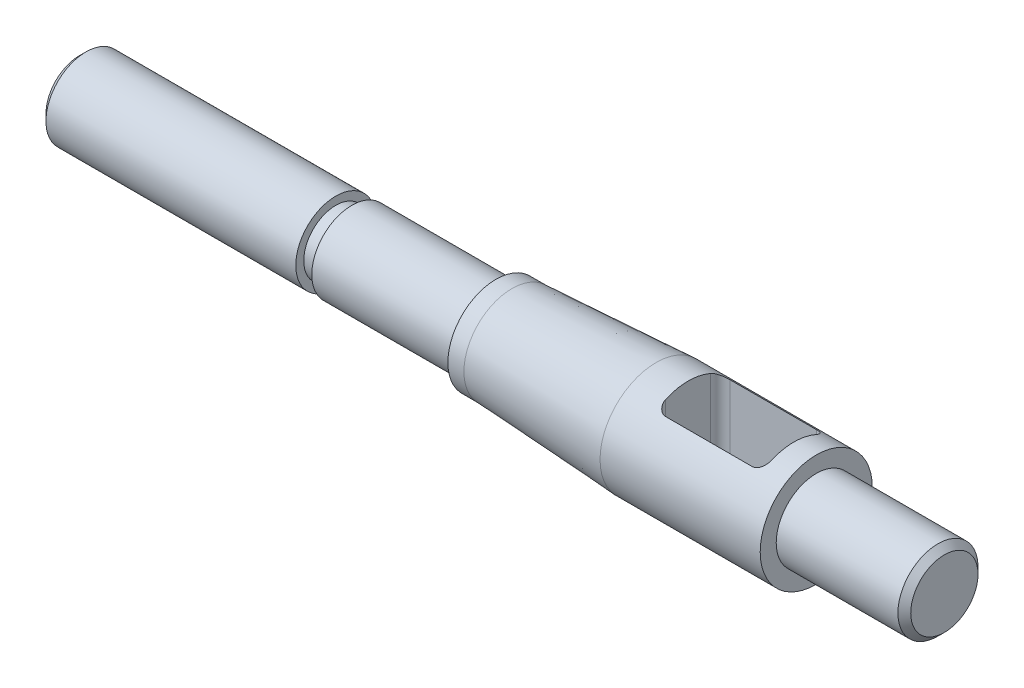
ISO-10303-21;
HEADER;
FILE_DESCRIPTION(('STEP AP214'),'2;1');
FILE_NAME('part.step','',(''),(''),'','','');
FILE_SCHEMA(('AUTOMOTIVE_DESIGN { 1 0 10303 214 1 1 1 1 }'));
ENDSEC;
DATA;
#1=APPLICATION_CONTEXT('core data for automotive mechanical design processes');
#2=APPLICATION_PROTOCOL_DEFINITION('international standard','automotive_design',2000,#1);
#3=PRODUCT_CONTEXT('',#1,'mechanical');
#4=PRODUCT('Part','Part','',(#3));
#5=PRODUCT_RELATED_PRODUCT_CATEGORY('part','',(#4));
#6=PRODUCT_DEFINITION_FORMATION('','',#4);
#7=PRODUCT_DEFINITION_CONTEXT('part definition',#1,'design');
#8=PRODUCT_DEFINITION('design','',#6,#7);
#9=PRODUCT_DEFINITION_SHAPE('','',#8);
#10=(LENGTH_UNIT() NAMED_UNIT(*) SI_UNIT(.MILLI.,.METRE.));
#11=(NAMED_UNIT(*) PLANE_ANGLE_UNIT() SI_UNIT($,.RADIAN.));
#12=(NAMED_UNIT(*) SI_UNIT($,.STERADIAN.) SOLID_ANGLE_UNIT());
#13=UNCERTAINTY_MEASURE_WITH_UNIT(LENGTH_MEASURE(1.E-05),#10,'distance_accuracy_value','');
#14=(GEOMETRIC_REPRESENTATION_CONTEXT(3) GLOBAL_UNCERTAINTY_ASSIGNED_CONTEXT((#13)) GLOBAL_UNIT_ASSIGNED_CONTEXT((#10,
#11,#12)) REPRESENTATION_CONTEXT('',''));
#15=CARTESIAN_POINT('',(0.,0.,0.));
#16=DIRECTION('',(0.,0.,1.));
#17=DIRECTION('',(1.,0.,0.));
#18=AXIS2_PLACEMENT_3D('',#15,#16,#17);
#19=CARTESIAN_POINT('',(130.,0.,0.));
#20=DIRECTION('',(-1.,0.,0.));
#21=DIRECTION('',(0.,0.,1.));
#22=AXIS2_PLACEMENT_3D('',#19,#20,#21);
#23=CYLINDRICAL_SURFACE('',#22,12.5);
#24=CARTESIAN_POINT('',(130.,0.,0.));
#25=DIRECTION('',(1.,0.,0.));
#26=DIRECTION('',(0.,0.,-1.));
#27=AXIS2_PLACEMENT_3D('',#24,#25,#26);
#28=CIRCLE('',#27,12.5);
#29=CARTESIAN_POINT('',(130.,0.,-12.5));
#30=VERTEX_POINT('',#29);
#31=EDGE_CURVE('E348',#30,#30,#28,.T.);
#32=ORIENTED_EDGE('',*,*,#31,.F.);
#33=EDGE_LOOP('',(#32));
#34=FACE_BOUND('',#33,.T.);
#35=CARTESIAN_POINT('',(85.,0.,0.));
#36=DIRECTION('',(-1.,0.,0.));
#37=DIRECTION('',(0.,0.,1.));
#38=AXIS2_PLACEMENT_3D('',#35,#36,#37);
#39=CIRCLE('',#38,12.5);
#40=CARTESIAN_POINT('',(85.,0.,12.5));
#41=VERTEX_POINT('',#40);
#42=EDGE_CURVE('E288',#41,#41,#39,.T.);
#43=ORIENTED_EDGE('',*,*,#42,.F.);
#44=EDGE_LOOP('',(#43));
#45=FACE_BOUND('',#44,.T.);
#46=ADVANCED_FACE('F32',(#34,#45),#23,.T.);
#47=CARTESIAN_POINT('',(230.,0.,0.));
#48=DIRECTION('',(-1.,0.,0.));
#49=DIRECTION('',(0.,0.,1.));
#50=AXIS2_PLACEMENT_3D('',#47,#48,#49);
#51=CYLINDRICAL_SURFACE('',#50,17.5);
#52=CARTESIAN_POINT('',(180.,0.,0.));
#53=DIRECTION('',(-1.,0.,0.));
#54=DIRECTION('',(0.,0.,1.));
#55=AXIS2_PLACEMENT_3D('',#52,#53,#54);
#56=CIRCLE('',#55,17.5);
#57=CARTESIAN_POINT('',(180.,0.,17.5));
#58=VERTEX_POINT('',#57);
#59=EDGE_CURVE('E287',#58,#58,#56,.T.);
#60=ORIENTED_EDGE('',*,*,#59,.F.);
#61=EDGE_LOOP('',(#60));
#62=FACE_BOUND('',#61,.T.);
#63=CARTESIAN_POINT('',(230.,0.,0.));
#64=DIRECTION('',(1.,0.,0.));
#65=DIRECTION('',(0.,0.,-1.));
#66=AXIS2_PLACEMENT_3D('',#63,#64,#65);
#67=CIRCLE('',#66,17.5);
#68=CARTESIAN_POINT('',(230.,0.,-17.5));
#69=VERTEX_POINT('',#68);
#70=EDGE_CURVE('E346',#69,#69,#67,.T.);
#71=ORIENTED_EDGE('',*,*,#70,.F.);
#72=EDGE_LOOP('',(#71));
#73=FACE_BOUND('',#72,.T.);
#74=DIRECTION('',(-1.,0.,0.));
#75=VECTOR('',#74,1.);
#76=CARTESIAN_POINT('',(230.,14.3614066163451,-10.));
#77=LINE('',#76,#75);
#78=CARTESIAN_POINT('',(220.,14.3614066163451,-10.));
#79=VERTEX_POINT('',#78);
#80=CARTESIAN_POINT('',(193.,14.3614066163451,-10.));
#81=VERTEX_POINT('',#80);
#82=EDGE_CURVE('E362',#79,#81,#77,.T.);
#83=ORIENTED_EDGE('',*,*,#82,.F.);
#84=CARTESIAN_POINT('',(220.,14.3614066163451,-10.));
#85=CARTESIAN_POINT('',(220.074647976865,14.3613913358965,-10.0000148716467));
#86=CARTESIAN_POINT('',(220.14928495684,14.363346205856,-9.9972143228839));
#87=CARTESIAN_POINT('',(220.297906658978,14.3710800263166,-9.98609744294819));
#88=CARTESIAN_POINT('',(220.371891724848,14.376856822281,-9.97778421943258));
#89=CARTESIAN_POINT('',(220.518218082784,14.3920720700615,-9.95582384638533));
#90=CARTESIAN_POINT('',(220.590566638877,14.4014880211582,-9.94220946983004));
#91=CARTESIAN_POINT('',(220.733552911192,14.4237677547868,-9.90985917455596));
#92=CARTESIAN_POINT('',(220.804190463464,14.4366318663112,-9.89112276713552));
#93=CARTESIAN_POINT('',(221.012551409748,14.4799675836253,-9.82767399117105));
#94=CARTESIAN_POINT('',(221.147144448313,14.5152285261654,-9.77565702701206));
#95=CARTESIAN_POINT('',(221.405051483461,14.5961112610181,-9.65447152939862));
#96=CARTESIAN_POINT('',(221.528348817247,14.6417480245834,-9.58527819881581));
#97=CARTESIAN_POINT('',(221.771363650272,14.7448936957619,-9.42591164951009));
#98=CARTESIAN_POINT('',(221.889979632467,14.8030653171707,-9.3344919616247));
#99=CARTESIAN_POINT('',(222.110622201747,14.9257100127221,-9.13710562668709));
#100=CARTESIAN_POINT('',(222.212642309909,14.9901855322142,-9.03113332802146));
#101=CARTESIAN_POINT('',(222.414888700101,15.134146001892,-8.78810094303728));
#102=CARTESIAN_POINT('',(222.511941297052,15.2143340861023,-8.6488081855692));
#103=CARTESIAN_POINT('',(222.680960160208,15.3766573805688,-8.35681562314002));
#104=CARTESIAN_POINT('',(222.752917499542,15.4587932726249,-8.20411107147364));
#105=CARTESIAN_POINT('',(222.873310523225,15.6263351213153,-7.88050452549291));
#106=CARTESIAN_POINT('',(222.920408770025,15.711702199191,-7.7090762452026));
#107=CARTESIAN_POINT('',(222.967916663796,15.8369301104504,-7.44655114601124));
#108=CARTESIAN_POINT('',(222.979896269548,15.8782252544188,-7.3580931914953));
#109=CARTESIAN_POINT('',(222.995936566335,15.9596005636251,-7.17988628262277));
#110=CARTESIAN_POINT('',(222.999995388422,15.9996804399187,-7.09013702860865));
#111=CARTESIAN_POINT('',(223.,16.0390149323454,-7.));
#112=B_SPLINE_CURVE_WITH_KNOTS('',3,(#84,#85,#86,#87,#88,#89,#90,#91,#92,#93,#94,#95,#96,#97,
#98,#99,#100,#101,#102,#103,#104,#105,#106,#107,#108,#109,#110,#111),.UNSPECIFIED.,.F.,.F.,(4,2,
2,2,2,2,2,2,2,2,2,2,2,4),(0.,0.223847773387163,0.447569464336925,0.669929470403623,
0.892310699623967,1.33580324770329,1.77993981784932,2.2601003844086,2.74044795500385,
3.3013994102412,3.86255020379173,4.45141939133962,4.74619356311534,5.04103727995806),.UNSPECIFIED.);
#113=CARTESIAN_POINT('',(223.,16.0390149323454,-7.));
#114=VERTEX_POINT('',#113);
#115=EDGE_CURVE('E179',#79,#114,#112,.T.);
#116=ORIENTED_EDGE('',*,*,#115,.T.);
#117=CARTESIAN_POINT('',(223.,0.,0.));
#118=DIRECTION('',(1.,0.,0.));
#119=DIRECTION('',(0.,0.,-1.));
#120=AXIS2_PLACEMENT_3D('',#117,#118,#119);
#121=CIRCLE('',#120,17.5);
#122=CARTESIAN_POINT('',(223.,16.0390149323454,7.));
#123=VERTEX_POINT('',#122);
#124=EDGE_CURVE('E356',#114,#123,#121,.T.);
#125=ORIENTED_EDGE('',*,*,#124,.T.);
#126=CARTESIAN_POINT('',(223.,16.0390149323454,7.));
#127=CARTESIAN_POINT('',(223.000002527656,15.9980461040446,7.09389265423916));
#128=CARTESIAN_POINT('',(222.995592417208,15.9562456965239,7.18739984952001));
#129=CARTESIAN_POINT('',(222.978181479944,15.8713420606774,7.37297987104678));
#130=CARTESIAN_POINT('',(222.965183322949,15.8282392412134,7.46505313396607));
#131=CARTESIAN_POINT('',(222.93084392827,15.7410991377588,7.64709013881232));
#132=CARTESIAN_POINT('',(222.909509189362,15.6970626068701,7.73705546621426));
#133=CARTESIAN_POINT('',(222.858750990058,15.6084190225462,7.91436044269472));
#134=CARTESIAN_POINT('',(222.829326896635,15.5638119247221,8.00169988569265));
#135=CARTESIAN_POINT('',(222.729311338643,15.4298134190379,8.25881438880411));
#136=CARTESIAN_POINT('',(222.646914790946,15.3400891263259,8.42400888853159));
#137=CARTESIAN_POINT('',(222.452423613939,15.1635807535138,8.73775454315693));
#138=CARTESIAN_POINT('',(222.340302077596,15.0767994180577,8.8862904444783));
#139=CARTESIAN_POINT('',(222.086849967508,14.9099842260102,9.16344105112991));
#140=CARTESIAN_POINT('',(221.945311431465,14.8300044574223,9.2919018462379));
#141=CARTESIAN_POINT('',(221.713584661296,14.7200950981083,9.46432782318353));
#142=CARTESIAN_POINT('',(221.633126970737,14.6851423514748,9.51841534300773));
#143=CARTESIAN_POINT('',(221.466126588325,14.6193523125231,9.61915483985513));
#144=CARTESIAN_POINT('',(221.379586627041,14.5885131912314,9.6658101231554));
#145=CARTESIAN_POINT('',(221.161522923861,14.5192499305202,9.76968953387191));
#146=CARTESIAN_POINT('',(221.026993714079,14.4834796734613,9.82249900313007));
#147=CARTESIAN_POINT('',(220.749348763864,14.4247681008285,9.90852252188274));
#148=CARTESIAN_POINT('',(220.606252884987,14.4017982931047,9.94178010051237));
#149=CARTESIAN_POINT('',(220.384909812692,14.3779555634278,9.97620093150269));
#150=CARTESIAN_POINT('',(220.308351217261,14.3717685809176,9.98510640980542));
#151=CARTESIAN_POINT('',(220.154542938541,14.3634882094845,9.99701102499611));
#152=CARTESIAN_POINT('',(220.077293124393,14.3613956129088,10.0000090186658));
#153=CARTESIAN_POINT('',(220.,14.3614066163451,10.));
#154=B_SPLINE_CURVE_WITH_KNOTS('',3,(#126,#127,#128,#129,#130,#131,#132,#133,#134,#135,#136,
#137,#138,#139,#140,#141,#142,#143,#144,#145,#146,#147,#148,#149,#150,#151,#152,#153),
.UNSPECIFIED.,.F.,.F.,(4,2,2,2,2,2,2,2,2,2,2,2,2,4),(0.,0.307194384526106,0.614293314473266,
0.921153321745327,1.22803734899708,1.84072633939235,2.45397184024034,3.07170985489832,
3.38043466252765,3.68902174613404,4.13371543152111,4.57741529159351,4.80908120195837,
5.04079193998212),.UNSPECIFIED.);
#155=CARTESIAN_POINT('',(220.,14.3614066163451,10.));
#156=VERTEX_POINT('',#155);
#157=EDGE_CURVE('E173',#123,#156,#154,.T.);
#158=ORIENTED_EDGE('',*,*,#157,.T.);
#159=DIRECTION('',(-1.,0.,0.));
#160=VECTOR('',#159,1.);
#161=CARTESIAN_POINT('',(230.,14.3614066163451,10.));
#162=LINE('',#161,#160);
#163=CARTESIAN_POINT('',(193.,14.3614066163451,10.));
#164=VERTEX_POINT('',#163);
#165=EDGE_CURVE('E351',#156,#164,#162,.T.);
#166=ORIENTED_EDGE('',*,*,#165,.T.);
#167=CARTESIAN_POINT('',(193.,14.3614066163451,10.));
#168=CARTESIAN_POINT('',(192.925352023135,14.3613913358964,10.0000148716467));
#169=CARTESIAN_POINT('',(192.85071504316,14.363346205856,9.99721432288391));
#170=CARTESIAN_POINT('',(192.702093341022,14.3710800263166,9.98609744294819));
#171=CARTESIAN_POINT('',(192.628108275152,14.376856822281,9.97778421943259));
#172=CARTESIAN_POINT('',(192.481781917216,14.3920720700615,9.95582384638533));
#173=CARTESIAN_POINT('',(192.409433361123,14.4014880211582,9.94220946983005));
#174=CARTESIAN_POINT('',(192.266447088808,14.4237677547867,9.90985917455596));
#175=CARTESIAN_POINT('',(192.195809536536,14.4366318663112,9.89112276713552));
#176=CARTESIAN_POINT('',(191.987448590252,14.4799675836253,9.82767399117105));
#177=CARTESIAN_POINT('',(191.852855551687,14.5152285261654,9.77565702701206));
#178=CARTESIAN_POINT('',(191.594948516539,14.5961112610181,9.65447152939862));
#179=CARTESIAN_POINT('',(191.471651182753,14.6417480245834,9.58527819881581));
#180=CARTESIAN_POINT('',(191.228636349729,14.7448936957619,9.42591164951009));
#181=CARTESIAN_POINT('',(191.110020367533,14.8030653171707,9.3344919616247));
#182=CARTESIAN_POINT('',(190.889377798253,14.9257100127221,9.13710562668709));
#183=CARTESIAN_POINT('',(190.787357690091,14.9901855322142,9.03113332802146));
#184=CARTESIAN_POINT('',(190.585111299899,15.134146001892,8.78810094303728));
#185=CARTESIAN_POINT('',(190.488058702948,15.2143340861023,8.6488081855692));
#186=CARTESIAN_POINT('',(190.319039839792,15.3766573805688,8.35681562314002));
#187=CARTESIAN_POINT('',(190.247082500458,15.4587932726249,8.20411107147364));
#188=CARTESIAN_POINT('',(190.126689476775,15.6263351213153,7.88050452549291));
#189=CARTESIAN_POINT('',(190.079591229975,15.711702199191,7.7090762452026));
#190=CARTESIAN_POINT('',(190.032083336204,15.8369301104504,7.44655114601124));
#191=CARTESIAN_POINT('',(190.020103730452,15.8782252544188,7.3580931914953));
#192=CARTESIAN_POINT('',(190.004063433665,15.9596005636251,7.17988628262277));
#193=CARTESIAN_POINT('',(190.000004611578,15.9996804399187,7.09013702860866));
#194=CARTESIAN_POINT('',(190.,16.0390149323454,7.));
#195=B_SPLINE_CURVE_WITH_KNOTS('',3,(#167,#168,#169,#170,#171,#172,#173,#174,#175,#176,#177,
#178,#179,#180,#181,#182,#183,#184,#185,#186,#187,#188,#189,#190,#191,#192,#193,#194),
.UNSPECIFIED.,.F.,.F.,(4,2,2,2,2,2,2,2,2,2,2,2,2,4),(0.,0.223847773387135,0.447569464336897,
0.669929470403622,0.892310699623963,1.33580324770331,1.77993981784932,2.26010038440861,
2.74044795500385,3.3013994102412,3.86255020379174,4.45141939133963,4.74619356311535,
5.04103727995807),.UNSPECIFIED.);
#196=CARTESIAN_POINT('',(190.,16.0390149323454,7.));
#197=VERTEX_POINT('',#196);
#198=EDGE_CURVE('E45',#164,#197,#195,.T.);
#199=ORIENTED_EDGE('',*,*,#198,.T.);
#200=CARTESIAN_POINT('',(190.,0.,0.));
#201=DIRECTION('',(-1.,0.,0.));
#202=DIRECTION('',(0.,0.,1.));
#203=AXIS2_PLACEMENT_3D('',#200,#201,#202);
#204=CIRCLE('',#203,17.5);
#205=CARTESIAN_POINT('',(190.,16.0390149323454,-7.));
#206=VERTEX_POINT('',#205);
#207=EDGE_CURVE('E359',#197,#206,#204,.T.);
#208=ORIENTED_EDGE('',*,*,#207,.T.);
#209=CARTESIAN_POINT('',(190.,16.0390149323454,-7.));
#210=CARTESIAN_POINT('',(189.999997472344,15.9980461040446,-7.09389265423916));
#211=CARTESIAN_POINT('',(190.004407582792,15.9562456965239,-7.18739984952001));
#212=CARTESIAN_POINT('',(190.021818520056,15.8713420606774,-7.37297987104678));
#213=CARTESIAN_POINT('',(190.034816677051,15.8282392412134,-7.46505313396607));
#214=CARTESIAN_POINT('',(190.06915607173,15.7410991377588,-7.64709013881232));
#215=CARTESIAN_POINT('',(190.090490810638,15.6970626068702,-7.73705546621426));
#216=CARTESIAN_POINT('',(190.141249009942,15.6084190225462,-7.91436044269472));
#217=CARTESIAN_POINT('',(190.170673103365,15.5638119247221,-8.00169988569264));
#218=CARTESIAN_POINT('',(190.270688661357,15.4298134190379,-8.2588143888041));
#219=CARTESIAN_POINT('',(190.353085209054,15.3400891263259,-8.42400888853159));
#220=CARTESIAN_POINT('',(190.547576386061,15.1635807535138,-8.73775454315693));
#221=CARTESIAN_POINT('',(190.659697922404,15.0767994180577,-8.8862904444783));
#222=CARTESIAN_POINT('',(190.913150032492,14.9099842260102,-9.1634410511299));
#223=CARTESIAN_POINT('',(191.054688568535,14.8300044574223,-9.29190184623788));
#224=CARTESIAN_POINT('',(191.286415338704,14.7200950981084,-9.46432782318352));
#225=CARTESIAN_POINT('',(191.366873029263,14.6851423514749,-9.51841534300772));
#226=CARTESIAN_POINT('',(191.533873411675,14.6193523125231,-9.61915483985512));
#227=CARTESIAN_POINT('',(191.620413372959,14.5885131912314,-9.66581012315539));
#228=CARTESIAN_POINT('',(191.838477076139,14.5192499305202,-9.76968953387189));
#229=CARTESIAN_POINT('',(191.973006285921,14.4834796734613,-9.82249900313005));
#230=CARTESIAN_POINT('',(192.250651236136,14.4247681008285,-9.90852252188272));
#231=CARTESIAN_POINT('',(192.393747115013,14.4017982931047,-9.94178010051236));
#232=CARTESIAN_POINT('',(192.615090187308,14.3779555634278,-9.9762009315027));
#233=CARTESIAN_POINT('',(192.691648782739,14.3717685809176,-9.98510640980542));
#234=CARTESIAN_POINT('',(192.845457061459,14.3634882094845,-9.99701102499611));
#235=CARTESIAN_POINT('',(192.922706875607,14.3613956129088,-10.0000090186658));
#236=CARTESIAN_POINT('',(193.,14.3614066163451,-10.));
#237=B_SPLINE_CURVE_WITH_KNOTS('',3,(#209,#210,#211,#212,#213,#214,#215,#216,#217,#218,#219,
#220,#221,#222,#223,#224,#225,#226,#227,#228,#229,#230,#231,#232,#233,#234,#235,#236),
.UNSPECIFIED.,.F.,.F.,(4,2,2,2,2,2,2,2,2,2,2,2,2,4),(0.,0.307194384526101,0.614293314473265,
0.92115332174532,1.22803734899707,1.84072633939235,2.45397184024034,3.07170985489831,
3.38043466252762,3.68902174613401,4.13371543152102,4.57741529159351,4.80908120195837,
5.04079193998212),.UNSPECIFIED.);
#238=EDGE_CURVE('E12',#206,#81,#237,.T.);
#239=ORIENTED_EDGE('',*,*,#238,.T.);
#240=EDGE_LOOP('',(#83,#116,#125,#158,#166,#199,#208,#239));
#241=FACE_BOUND('',#240,.T.);
#242=ADVANCED_FACE('F184',(#62,#73,#241),#51,.T.);
#243=CARTESIAN_POINT('',(230.,0.,0.));
#244=DIRECTION('',(1.,0.,0.));
#245=DIRECTION('',(0.,0.,-1.));
#246=AXIS2_PLACEMENT_3D('',#243,#244,#245);
#247=PLANE('',#246);
#248=ORIENTED_EDGE('',*,*,#70,.T.);
#249=EDGE_LOOP('',(#248));
#250=FACE_BOUND('',#249,.T.);
#251=CARTESIAN_POINT('',(230.,0.,0.));
#252=DIRECTION('',(1.,0.,0.));
#253=DIRECTION('',(0.,0.,-1.));
#254=AXIS2_PLACEMENT_3D('',#251,#252,#253);
#255=CIRCLE('',#254,12.5);
#256=CARTESIAN_POINT('',(230.,0.,12.5));
#257=VERTEX_POINT('',#256);
#258=EDGE_CURVE('E343',#257,#257,#255,.T.);
#259=ORIENTED_EDGE('',*,*,#258,.F.);
#260=EDGE_LOOP('',(#259));
#261=FACE_BOUND('',#260,.T.);
#262=ADVANCED_FACE('F257',(#250,#261),#247,.T.);
#263=CARTESIAN_POINT('',(270.,0.,0.));
#264=DIRECTION('',(-1.,0.,0.));
#265=DIRECTION('',(0.,0.,1.));
#266=AXIS2_PLACEMENT_3D('',#263,#264,#265);
#267=CYLINDRICAL_SURFACE('',#266,12.5);
#268=CARTESIAN_POINT('',(268.,0.,0.));
#269=DIRECTION('',(1.,0.,0.));
#270=DIRECTION('',(0.,0.,-1.));
#271=AXIS2_PLACEMENT_3D('',#268,#269,#270);
#272=CIRCLE('',#271,12.5);
#273=CARTESIAN_POINT('',(268.,0.,12.5));
#274=VERTEX_POINT('',#273);
#275=EDGE_CURVE('E368',#274,#274,#272,.F.);
#276=CARTESIAN_POINT('',(268.,0.,12.5));
#277=CARTESIAN_POINT('',(267.604166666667,0.,12.5));
#278=CARTESIAN_POINT('',(267.208333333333,0.,12.5));
#279=CARTESIAN_POINT('',(266.416666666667,0.,12.5));
#280=CARTESIAN_POINT('',(266.020833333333,0.,12.5));
#281=CARTESIAN_POINT('',(265.229166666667,0.,12.5));
#282=CARTESIAN_POINT('',(264.833333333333,0.,12.5));
#283=CARTESIAN_POINT('',(264.041666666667,0.,12.5));
#284=CARTESIAN_POINT('',(263.645833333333,0.,12.5));
#285=CARTESIAN_POINT('',(262.854166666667,0.,12.5));
#286=CARTESIAN_POINT('',(262.458333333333,0.,12.5));
#287=CARTESIAN_POINT('',(261.666666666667,0.,12.5));
#288=CARTESIAN_POINT('',(261.270833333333,0.,12.5));
#289=CARTESIAN_POINT('',(260.479166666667,0.,12.5));
#290=CARTESIAN_POINT('',(260.083333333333,0.,12.5));
#291=CARTESIAN_POINT('',(259.291666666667,0.,12.5));
#292=CARTESIAN_POINT('',(258.895833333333,0.,12.5));
#293=CARTESIAN_POINT('',(258.104166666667,0.,12.5));
#294=CARTESIAN_POINT('',(257.708333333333,0.,12.5));
#295=CARTESIAN_POINT('',(256.916666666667,0.,12.5));
#296=CARTESIAN_POINT('',(256.520833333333,0.,12.5));
#297=CARTESIAN_POINT('',(255.729166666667,0.,12.5));
#298=CARTESIAN_POINT('',(255.333333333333,0.,12.5));
#299=CARTESIAN_POINT('',(254.541666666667,0.,12.5));
#300=CARTESIAN_POINT('',(254.145833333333,0.,12.5));
#301=CARTESIAN_POINT('',(253.354166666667,0.,12.5));
#302=CARTESIAN_POINT('',(252.958333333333,0.,12.5));
#303=CARTESIAN_POINT('',(252.166666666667,0.,12.5));
#304=CARTESIAN_POINT('',(251.770833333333,0.,12.5));
#305=CARTESIAN_POINT('',(250.979166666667,0.,12.5));
#306=CARTESIAN_POINT('',(250.583333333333,0.,12.5));
#307=CARTESIAN_POINT('',(249.791666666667,0.,12.5));
#308=CARTESIAN_POINT('',(249.395833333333,0.,12.5));
#309=CARTESIAN_POINT('',(248.604166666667,0.,12.5));
#310=CARTESIAN_POINT('',(248.208333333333,0.,12.5));
#311=CARTESIAN_POINT('',(247.416666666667,0.,12.5));
#312=CARTESIAN_POINT('',(247.020833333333,0.,12.5));
#313=CARTESIAN_POINT('',(246.229166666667,0.,12.5));
#314=CARTESIAN_POINT('',(245.833333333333,0.,12.5));
#315=CARTESIAN_POINT('',(245.041666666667,0.,12.5));
#316=CARTESIAN_POINT('',(244.645833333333,0.,12.5));
#317=CARTESIAN_POINT('',(243.854166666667,0.,12.5));
#318=CARTESIAN_POINT('',(243.458333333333,0.,12.5));
#319=CARTESIAN_POINT('',(242.666666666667,0.,12.5));
#320=CARTESIAN_POINT('',(242.270833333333,0.,12.5));
#321=CARTESIAN_POINT('',(241.479166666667,0.,12.5));
#322=CARTESIAN_POINT('',(241.083333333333,0.,12.5));
#323=CARTESIAN_POINT('',(240.291666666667,0.,12.5));
#324=CARTESIAN_POINT('',(239.895833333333,0.,12.5));
#325=CARTESIAN_POINT('',(239.104166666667,0.,12.5));
#326=CARTESIAN_POINT('',(238.708333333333,0.,12.5));
#327=CARTESIAN_POINT('',(237.916666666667,0.,12.5));
#328=CARTESIAN_POINT('',(237.520833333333,0.,12.5));
#329=CARTESIAN_POINT('',(236.729166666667,0.,12.5));
#330=CARTESIAN_POINT('',(236.333333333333,0.,12.5));
#331=CARTESIAN_POINT('',(235.541666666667,0.,12.5));
#332=CARTESIAN_POINT('',(235.145833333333,0.,12.5));
#333=CARTESIAN_POINT('',(234.354166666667,0.,12.5));
#334=CARTESIAN_POINT('',(233.958333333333,0.,12.5));
#335=CARTESIAN_POINT('',(233.166666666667,0.,12.5));
#336=CARTESIAN_POINT('',(232.770833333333,0.,12.5));
#337=CARTESIAN_POINT('',(231.979166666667,0.,12.5));
#338=CARTESIAN_POINT('',(231.583333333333,0.,12.5));
#339=CARTESIAN_POINT('',(230.791666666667,0.,12.5));
#340=CARTESIAN_POINT('',(230.395833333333,0.,12.5));
#341=CARTESIAN_POINT('',(230.,0.,12.5));
#342=B_SPLINE_CURVE_WITH_KNOTS('',3,(#276,#277,#278,#279,#280,#281,#282,#283,#284,#285,#286,
#287,#288,#289,#290,#291,#292,#293,#294,#295,#296,#297,#298,#299,#300,#301,#302,#303,#304,#305,
#306,#307,#308,#309,#310,#311,#312,#313,#314,#315,#316,#317,#318,#319,#320,#321,#322,#323,#324,
#325,#326,#327,#328,#329,#330,#331,#332,#333,#334,#335,#336,#337,#338,#339,#340,#341),
.UNSPECIFIED.,.F.,.F.,(4,2,2,2,2,2,2,2,2,2,2,2,2,2,2,2,2,2,2,2,2,2,2,2,2,2,2,2,2,2,2,2,4),(0.,
1.18749999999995,2.37499999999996,3.56249999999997,4.74999999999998,5.93749999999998,
7.12499999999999,8.31249999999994,9.49999999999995,10.6875,11.875,13.0625,14.25,
15.4374999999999,16.6249999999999,17.8125,19.,20.1875,21.375,22.5625,23.75,24.9374999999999,
26.125,27.3125,28.4999999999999,29.6875,30.875,32.0624999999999,33.2499999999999,34.4375,
35.6249999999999,36.8124999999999,38.),.UNSPECIFIED.);
#343=EDGE_CURVE('BSEAM253',#274,#257,#342,.T.);
#344=ORIENTED_EDGE('',*,*,#275,.T.);
#345=ORIENTED_EDGE('',*,*,#258,.T.);
#346=ORIENTED_EDGE('',*,*,#343,.T.);
#347=ORIENTED_EDGE('',*,*,#343,.F.);
#348=EDGE_LOOP('',(#344,#346,#345,#347));
#349=FACE_BOUND('',#348,.T.);
#350=ADVANCED_FACE('F253',(#349),#267,.T.);
#351=CARTESIAN_POINT('',(270.,0.,0.));
#352=DIRECTION('',(1.,0.,0.));
#353=DIRECTION('',(0.,0.,-1.));
#354=AXIS2_PLACEMENT_3D('',#351,#352,#353);
#355=PLANE('',#354);
#356=CARTESIAN_POINT('',(270.,0.,0.));
#357=DIRECTION('',(1.,0.,0.));
#358=DIRECTION('',(0.,0.,-1.));
#359=AXIS2_PLACEMENT_3D('',#356,#357,#358);
#360=CIRCLE('',#359,10.5);
#361=CARTESIAN_POINT('',(270.,0.,-10.5));
#362=VERTEX_POINT('',#361);
#363=EDGE_CURVE('E365',#362,#362,#360,.T.);
#364=ORIENTED_EDGE('',*,*,#363,.T.);
#365=EDGE_LOOP('',(#364));
#366=FACE_BOUND('',#365,.T.);
#367=ADVANCED_FACE('F249',(#366),#355,.T.);
#368=CARTESIAN_POINT('',(0.,0.,0.));
#369=DIRECTION('',(-1.,0.,0.));
#370=DIRECTION('',(0.,0.,1.));
#371=AXIS2_PLACEMENT_3D('',#368,#369,#370);
#372=CYLINDRICAL_SURFACE('',#371,15.);
#373=CARTESIAN_POINT('',(135.,0.,0.));
#374=DIRECTION('',(-1.,0.,0.));
#375=DIRECTION('',(0.,0.,1.));
#376=AXIS2_PLACEMENT_3D('',#373,#374,#375);
#377=CIRCLE('',#376,15.);
#378=CARTESIAN_POINT('',(135.,0.,15.));
#379=VERTEX_POINT('',#378);
#380=EDGE_CURVE('E291',#379,#379,#377,.T.);
#381=ORIENTED_EDGE('',*,*,#380,.T.);
#382=EDGE_LOOP('',(#381));
#383=FACE_BOUND('',#382,.T.);
#384=CARTESIAN_POINT('',(130.,0.,0.));
#385=DIRECTION('',(1.,0.,0.));
#386=DIRECTION('',(0.,0.,-1.));
#387=AXIS2_PLACEMENT_3D('',#384,#385,#386);
#388=CIRCLE('',#387,15.);
#389=CARTESIAN_POINT('',(130.,0.,-15.));
#390=VERTEX_POINT('',#389);
#391=EDGE_CURVE('E342',#390,#390,#388,.T.);
#392=ORIENTED_EDGE('',*,*,#391,.T.);
#393=EDGE_LOOP('',(#392));
#394=FACE_BOUND('',#393,.T.);
#395=ADVANCED_FACE('F245',(#383,#394),#372,.T.);
#396=CARTESIAN_POINT('',(135.,0.,0.));
#397=DIRECTION('',(1.,0.,0.));
#398=DIRECTION('',(0.,0.,-1.));
#399=AXIS2_PLACEMENT_3D('',#396,#397,#398);
#400=CONICAL_SURFACE('',#399,15.,0.055498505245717);
#401=ORIENTED_EDGE('',*,*,#59,.T.);
#402=EDGE_LOOP('',(#401));
#403=FACE_BOUND('',#402,.T.);
#404=ORIENTED_EDGE('',*,*,#380,.F.);
#405=EDGE_LOOP('',(#404));
#406=FACE_BOUND('',#405,.T.);
#407=ADVANCED_FACE('F242',(#403,#406),#400,.T.);
#408=CARTESIAN_POINT('',(130.,0.,0.));
#409=DIRECTION('',(1.,0.,0.));
#410=DIRECTION('',(0.,0.,-1.));
#411=AXIS2_PLACEMENT_3D('',#408,#409,#410);
#412=PLANE('',#411);
#413=ORIENTED_EDGE('',*,*,#31,.T.);
#414=EDGE_LOOP('',(#413));
#415=FACE_BOUND('',#414,.T.);
#416=ORIENTED_EDGE('',*,*,#391,.F.);
#417=EDGE_LOOP('',(#416));
#418=FACE_BOUND('',#417,.T.);
#419=ADVANCED_FACE('F240',(#415,#418),#412,.F.);
#420=CARTESIAN_POINT('',(190.,23.0555555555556,-10.));
#421=DIRECTION('',(-1.,0.,0.));
#422=DIRECTION('',(0.,0.,1.));
#423=AXIS2_PLACEMENT_3D('',#420,#421,#422);
#424=PLANE('',#423);
#425=ORIENTED_EDGE('',*,*,#207,.F.);
#426=DIRECTION('',(0.,-1.,0.));
#427=VECTOR('',#426,1.);
#428=CARTESIAN_POINT('',(190.,-12.,7.));
#429=LINE('',#428,#427);
#430=CARTESIAN_POINT('',(190.,-9.00000000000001,7.));
#431=VERTEX_POINT('',#430);
#432=EDGE_CURVE('E155',#197,#431,#429,.T.);
#433=ORIENTED_EDGE('',*,*,#432,.T.);
#434=DIRECTION('',(0.,0.,1.));
#435=VECTOR('',#434,1.);
#436=CARTESIAN_POINT('',(190.,-9.00000000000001,-10.));
#437=LINE('',#436,#435);
#438=CARTESIAN_POINT('',(190.,-9.00000000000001,-7.));
#439=VERTEX_POINT('',#438);
#440=EDGE_CURVE('E120',#431,#439,#437,.F.);
#441=ORIENTED_EDGE('',*,*,#440,.T.);
#442=DIRECTION('',(0.,-1.,0.));
#443=VECTOR('',#442,1.);
#444=CARTESIAN_POINT('',(190.,23.0555555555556,-7.));
#445=LINE('',#444,#443);
#446=EDGE_CURVE('E148',#439,#206,#445,.F.);
#447=ORIENTED_EDGE('',*,*,#446,.T.);
#448=EDGE_LOOP('',(#425,#433,#441,#447));
#449=FACE_BOUND('',#448,.T.);
#450=ADVANCED_FACE('F234',(#449),#424,.F.);
#451=CARTESIAN_POINT('',(223.,23.0555555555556,-10.));
#452=DIRECTION('',(1.,0.,0.));
#453=DIRECTION('',(0.,0.,-1.));
#454=AXIS2_PLACEMENT_3D('',#451,#452,#453);
#455=PLANE('',#454);
#456=DIRECTION('',(0.,0.,1.));
#457=VECTOR('',#456,1.);
#458=CARTESIAN_POINT('',(223.,-9.00000000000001,10.));
#459=LINE('',#458,#457);
#460=CARTESIAN_POINT('',(223.,-9.00000000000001,-7.));
#461=VERTEX_POINT('',#460);
#462=CARTESIAN_POINT('',(223.,-9.00000000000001,7.));
#463=VERTEX_POINT('',#462);
#464=EDGE_CURVE('E165',#461,#463,#459,.T.);
#465=ORIENTED_EDGE('',*,*,#464,.T.);
#466=DIRECTION('',(0.,1.,0.));
#467=VECTOR('',#466,1.);
#468=CARTESIAN_POINT('',(223.,14.3614066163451,7.));
#469=LINE('',#468,#467);
#470=EDGE_CURVE('E167',#463,#123,#469,.T.);
#471=ORIENTED_EDGE('',*,*,#470,.T.);
#472=ORIENTED_EDGE('',*,*,#124,.F.);
#473=DIRECTION('',(0.,1.,0.));
#474=VECTOR('',#473,1.);
#475=CARTESIAN_POINT('',(223.,23.0555555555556,-7.));
#476=LINE('',#475,#474);
#477=EDGE_CURVE('E163',#114,#461,#476,.F.);
#478=ORIENTED_EDGE('',*,*,#477,.T.);
#479=EDGE_LOOP('',(#465,#471,#472,#478));
#480=FACE_BOUND('',#479,.T.);
#481=ADVANCED_FACE('F230',(#480),#455,.F.);
#482=CARTESIAN_POINT('',(190.,-12.,-10.));
#483=DIRECTION('',(0.,0.,1.));
#484=DIRECTION('',(1.,0.,0.));
#485=AXIS2_PLACEMENT_3D('',#482,#483,#484);
#486=PLANE('',#485);
#487=DIRECTION('',(1.,0.,0.));
#488=VECTOR('',#487,1.);
#489=CARTESIAN_POINT('',(190.,-9.00000000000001,-10.));
#490=LINE('',#489,#488);
#491=CARTESIAN_POINT('',(193.,-9.00000000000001,-10.));
#492=VERTEX_POINT('',#491);
#493=CARTESIAN_POINT('',(220.,-9.00000000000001,-10.));
#494=VERTEX_POINT('',#493);
#495=EDGE_CURVE('E159',#492,#494,#490,.T.);
#496=ORIENTED_EDGE('',*,*,#495,.T.);
#497=DIRECTION('',(0.,1.,0.));
#498=VECTOR('',#497,1.);
#499=CARTESIAN_POINT('',(220.,-12.,-10.));
#500=LINE('',#499,#498);
#501=EDGE_CURVE('E161',#494,#79,#500,.T.);
#502=ORIENTED_EDGE('',*,*,#501,.T.);
#503=ORIENTED_EDGE('',*,*,#82,.T.);
#504=DIRECTION('',(0.,-1.,0.));
#505=VECTOR('',#504,1.);
#506=CARTESIAN_POINT('',(193.,-12.,-10.));
#507=LINE('',#506,#505);
#508=EDGE_CURVE('E157',#81,#492,#507,.T.);
#509=ORIENTED_EDGE('',*,*,#508,.T.);
#510=EDGE_LOOP('',(#496,#502,#503,#509));
#511=FACE_BOUND('',#510,.T.);
#512=ADVANCED_FACE('F227',(#511),#486,.T.);
#513=CARTESIAN_POINT('',(190.,-12.,10.));
#514=DIRECTION('',(0.,0.,1.));
#515=DIRECTION('',(1.,0.,0.));
#516=AXIS2_PLACEMENT_3D('',#513,#514,#515);
#517=PLANE('',#516);
#518=ORIENTED_EDGE('',*,*,#165,.F.);
#519=DIRECTION('',(0.,1.,0.));
#520=VECTOR('',#519,1.);
#521=CARTESIAN_POINT('',(220.,-12.,10.));
#522=LINE('',#521,#520);
#523=CARTESIAN_POINT('',(220.,-9.00000000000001,10.));
#524=VERTEX_POINT('',#523);
#525=EDGE_CURVE('E52',#156,#524,#522,.F.);
#526=ORIENTED_EDGE('',*,*,#525,.T.);
#527=DIRECTION('',(1.,0.,0.));
#528=VECTOR('',#527,1.);
#529=CARTESIAN_POINT('',(190.,-9.00000000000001,10.));
#530=LINE('',#529,#528);
#531=CARTESIAN_POINT('',(193.,-9.00000000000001,10.));
#532=VERTEX_POINT('',#531);
#533=EDGE_CURVE('E57',#524,#532,#530,.F.);
#534=ORIENTED_EDGE('',*,*,#533,.T.);
#535=DIRECTION('',(0.,-1.,0.));
#536=VECTOR('',#535,1.);
#537=CARTESIAN_POINT('',(193.,14.3614066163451,10.));
#538=LINE('',#537,#536);
#539=EDGE_CURVE('E169',#532,#164,#538,.F.);
#540=ORIENTED_EDGE('',*,*,#539,.T.);
#541=EDGE_LOOP('',(#518,#526,#534,#540));
#542=FACE_BOUND('',#541,.T.);
#543=ADVANCED_FACE('F224',(#542),#517,.F.);
#544=CARTESIAN_POINT('',(190.,-12.,-10.));
#545=DIRECTION('',(0.,-1.,0.));
#546=DIRECTION('',(0.,0.,-1.));
#547=AXIS2_PLACEMENT_3D('',#544,#545,#546);
#548=PLANE('',#547);
#549=DIRECTION('',(1.,0.,0.));
#550=VECTOR('',#549,1.);
#551=CARTESIAN_POINT('',(190.,-12.,-7.));
#552=LINE('',#551,#550);
#553=CARTESIAN_POINT('',(220.,-12.,-7.));
#554=VERTEX_POINT('',#553);
#555=CARTESIAN_POINT('',(193.,-12.,-7.));
#556=VERTEX_POINT('',#555);
#557=EDGE_CURVE('E146',#554,#556,#552,.F.);
#558=ORIENTED_EDGE('',*,*,#557,.T.);
#559=DIRECTION('',(0.,0.,1.));
#560=VECTOR('',#559,1.);
#561=CARTESIAN_POINT('',(193.,-12.,10.));
#562=LINE('',#561,#560);
#563=CARTESIAN_POINT('',(193.,-12.,7.));
#564=VERTEX_POINT('',#563);
#565=EDGE_CURVE('E118',#556,#564,#562,.T.);
#566=ORIENTED_EDGE('',*,*,#565,.T.);
#567=DIRECTION('',(1.,0.,0.));
#568=VECTOR('',#567,1.);
#569=CARTESIAN_POINT('',(223.,-12.,7.));
#570=LINE('',#569,#568);
#571=CARTESIAN_POINT('',(220.,-12.,7.));
#572=VERTEX_POINT('',#571);
#573=EDGE_CURVE('E135',#564,#572,#570,.T.);
#574=ORIENTED_EDGE('',*,*,#573,.T.);
#575=DIRECTION('',(0.,0.,1.));
#576=VECTOR('',#575,1.);
#577=CARTESIAN_POINT('',(220.,-12.,-10.));
#578=LINE('',#577,#576);
#579=EDGE_CURVE('E141',#572,#554,#578,.F.);
#580=ORIENTED_EDGE('',*,*,#579,.T.);
#581=EDGE_LOOP('',(#558,#566,#574,#580));
#582=FACE_BOUND('',#581,.T.);
#583=ADVANCED_FACE('F144',(#582),#548,.F.);
#584=CARTESIAN_POINT('',(270.,0.,0.));
#585=DIRECTION('',(-1.,0.,0.));
#586=DIRECTION('',(0.,0.,1.));
#587=AXIS2_PLACEMENT_3D('',#584,#585,#586);
#588=CONICAL_SURFACE('',#587,10.5,0.785398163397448);
#589=ORIENTED_EDGE('',*,*,#275,.F.);
#590=EDGE_LOOP('',(#589));
#591=FACE_BOUND('',#590,.T.);
#592=ORIENTED_EDGE('',*,*,#363,.F.);
#593=EDGE_LOOP('',(#592));
#594=FACE_BOUND('',#593,.T.);
#595=ADVANCED_FACE('F215',(#591,#594),#588,.T.);
#596=CARTESIAN_POINT('',(80.,25.5555555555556,0.));
#597=DIRECTION('',(1.,0.,0.));
#598=DIRECTION('',(0.,0.,-1.));
#599=AXIS2_PLACEMENT_3D('',#596,#597,#598);
#600=PLANE('',#599);
#601=CARTESIAN_POINT('',(80.,0.,0.));
#602=DIRECTION('',(-1.,0.,0.));
#603=DIRECTION('',(0.,0.,1.));
#604=AXIS2_PLACEMENT_3D('',#601,#602,#603);
#605=CIRCLE('',#604,10.);
#606=CARTESIAN_POINT('',(80.,0.,10.));
#607=VERTEX_POINT('',#606);
#608=EDGE_CURVE('E294',#607,#607,#605,.T.);
#609=ORIENTED_EDGE('',*,*,#608,.T.);
#610=EDGE_LOOP('',(#609));
#611=FACE_BOUND('',#610,.T.);
#612=CARTESIAN_POINT('',(80.,0.,0.));
#613=DIRECTION('',(1.,0.,0.));
#614=DIRECTION('',(0.,0.,-1.));
#615=AXIS2_PLACEMENT_3D('',#612,#613,#614);
#616=CIRCLE('',#615,12.5);
#617=CARTESIAN_POINT('',(80.,0.,-12.5));
#618=VERTEX_POINT('',#617);
#619=EDGE_CURVE('E285',#618,#618,#616,.T.);
#620=ORIENTED_EDGE('',*,*,#619,.T.);
#621=EDGE_LOOP('',(#620));
#622=FACE_BOUND('',#621,.T.);
#623=ADVANCED_FACE('F207',(#611,#622),#600,.T.);
#624=CARTESIAN_POINT('',(85.,25.5555555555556,0.));
#625=DIRECTION('',(-1.,0.,0.));
#626=DIRECTION('',(0.,0.,1.));
#627=AXIS2_PLACEMENT_3D('',#624,#625,#626);
#628=PLANE('',#627);
#629=CARTESIAN_POINT('',(85.,0.,0.));
#630=DIRECTION('',(-1.,0.,0.));
#631=DIRECTION('',(0.,0.,1.));
#632=AXIS2_PLACEMENT_3D('',#629,#630,#631);
#633=CIRCLE('',#632,10.);
#634=CARTESIAN_POINT('',(85.,0.,10.));
#635=VERTEX_POINT('',#634);
#636=EDGE_CURVE('E335',#635,#635,#633,.T.);
#637=ORIENTED_EDGE('',*,*,#636,.F.);
#638=EDGE_LOOP('',(#637));
#639=FACE_BOUND('',#638,.T.);
#640=ORIENTED_EDGE('',*,*,#42,.T.);
#641=EDGE_LOOP('',(#640));
#642=FACE_BOUND('',#641,.T.);
#643=ADVANCED_FACE('F203',(#639,#642),#628,.T.);
#644=CARTESIAN_POINT('',(0.,0.,0.));
#645=DIRECTION('',(-1.,0.,0.));
#646=DIRECTION('',(0.,0.,1.));
#647=AXIS2_PLACEMENT_3D('',#644,#645,#646);
#648=CYLINDRICAL_SURFACE('',#647,10.);
#649=ORIENTED_EDGE('',*,*,#636,.T.);
#650=EDGE_LOOP('',(#649));
#651=FACE_BOUND('',#650,.T.);
#652=ORIENTED_EDGE('',*,*,#608,.F.);
#653=EDGE_LOOP('',(#652));
#654=FACE_BOUND('',#653,.T.);
#655=ADVANCED_FACE('F206',(#651,#654),#648,.T.);
#656=CARTESIAN_POINT('',(0.,0.,0.));
#657=DIRECTION('',(1.,0.,0.));
#658=DIRECTION('',(0.,0.,-1.));
#659=AXIS2_PLACEMENT_3D('',#656,#657,#658);
#660=PLANE('',#659);
#661=CARTESIAN_POINT('',(0.,0.,0.));
#662=DIRECTION('',(1.,0.,0.));
#663=DIRECTION('',(0.,0.,-1.));
#664=AXIS2_PLACEMENT_3D('',#661,#662,#663);
#665=CIRCLE('',#664,10.5);
#666=CARTESIAN_POINT('',(0.,0.,-10.5));
#667=VERTEX_POINT('',#666);
#668=EDGE_CURVE('E142',#667,#667,#665,.F.);
#669=ORIENTED_EDGE('',*,*,#668,.T.);
#670=EDGE_LOOP('',(#669));
#671=FACE_BOUND('',#670,.T.);
#672=ADVANCED_FACE('F211',(#671),#660,.F.);
#673=CARTESIAN_POINT('',(2.,0.,0.));
#674=DIRECTION('',(1.,0.,0.));
#675=DIRECTION('',(0.,0.,-1.));
#676=AXIS2_PLACEMENT_3D('',#673,#674,#675);
#677=CONICAL_SURFACE('',#676,12.5,0.785398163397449);
#678=ORIENTED_EDGE('',*,*,#668,.F.);
#679=EDGE_LOOP('',(#678));
#680=FACE_BOUND('',#679,.T.);
#681=CARTESIAN_POINT('',(2.,0.,0.));
#682=DIRECTION('',(1.,0.,0.));
#683=DIRECTION('',(0.,0.,-1.));
#684=AXIS2_PLACEMENT_3D('',#681,#682,#683);
#685=CIRCLE('',#684,12.5);
#686=CARTESIAN_POINT('',(2.,0.,-12.5));
#687=VERTEX_POINT('',#686);
#688=EDGE_CURVE('E282',#687,#687,#685,.T.);
#689=ORIENTED_EDGE('',*,*,#688,.F.);
#690=EDGE_LOOP('',(#689));
#691=FACE_BOUND('',#690,.T.);
#692=ADVANCED_FACE('F217',(#680,#691),#677,.T.);
#693=ORIENTED_EDGE('',*,*,#688,.T.);
#694=EDGE_LOOP('',(#693));
#695=FACE_BOUND('',#694,.T.);
#696=ORIENTED_EDGE('',*,*,#619,.F.);
#697=EDGE_LOOP('',(#696));
#698=FACE_BOUND('',#697,.T.);
#699=ADVANCED_FACE('F34',(#695,#698),#23,.T.);
#700=CARTESIAN_POINT('',(220.,-12.,-7.));
#701=DIRECTION('',(0.,1.,0.));
#702=DIRECTION('',(0.,0.,1.));
#703=AXIS2_PLACEMENT_3D('',#700,#701,#702);
#704=CYLINDRICAL_SURFACE('',#703,3.);
#705=ORIENTED_EDGE('',*,*,#115,.F.);
#706=ORIENTED_EDGE('',*,*,#501,.F.);
#707=CARTESIAN_POINT('',(220.,-9.00000000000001,-7.));
#708=DIRECTION('',(0.,1.,0.));
#709=DIRECTION('',(0.,0.,1.));
#710=AXIS2_PLACEMENT_3D('',#707,#708,#709);
#711=CIRCLE('',#710,3.);
#712=EDGE_CURVE('E307',#461,#494,#711,.T.);
#713=ORIENTED_EDGE('',*,*,#712,.F.);
#714=ORIENTED_EDGE('',*,*,#477,.F.);
#715=EDGE_LOOP('',(#705,#706,#713,#714));
#716=FACE_BOUND('',#715,.T.);
#717=ADVANCED_FACE('F197',(#716),#704,.F.);
#718=CARTESIAN_POINT('',(220.,-9.00000000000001,-10.));
#719=DIRECTION('',(0.,0.,-1.));
#720=DIRECTION('',(-1.,0.,0.));
#721=AXIS2_PLACEMENT_3D('',#718,#719,#720);
#722=CYLINDRICAL_SURFACE('',#721,3.);
#723=CARTESIAN_POINT('',(220.,-9.00000000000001,7.));
#724=DIRECTION('',(0.,0.,-1.));
#725=DIRECTION('',(-1.,0.,0.));
#726=AXIS2_PLACEMENT_3D('',#723,#724,#725);
#727=CIRCLE('',#726,3.);
#728=EDGE_CURVE('E308',#463,#572,#727,.T.);
#729=ORIENTED_EDGE('',*,*,#728,.F.);
#730=ORIENTED_EDGE('',*,*,#464,.F.);
#731=CARTESIAN_POINT('',(220.,-9.00000000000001,-7.));
#732=DIRECTION('',(0.,0.,1.));
#733=DIRECTION('',(1.,0.,0.));
#734=AXIS2_PLACEMENT_3D('',#731,#732,#733);
#735=CIRCLE('',#734,3.);
#736=EDGE_CURVE('E302',#554,#461,#735,.T.);
#737=ORIENTED_EDGE('',*,*,#736,.F.);
#738=ORIENTED_EDGE('',*,*,#579,.F.);
#739=EDGE_LOOP('',(#729,#730,#737,#738));
#740=FACE_BOUND('',#739,.T.);
#741=ADVANCED_FACE('F193',(#740),#722,.F.);
#742=CARTESIAN_POINT('',(220.,23.0555555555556,7.));
#743=DIRECTION('',(0.,-1.,0.));
#744=DIRECTION('',(0.,0.,-1.));
#745=AXIS2_PLACEMENT_3D('',#742,#743,#744);
#746=CYLINDRICAL_SURFACE('',#745,3.);
#747=ORIENTED_EDGE('',*,*,#157,.F.);
#748=ORIENTED_EDGE('',*,*,#470,.F.);
#749=CARTESIAN_POINT('',(220.,-9.00000000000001,7.));
#750=DIRECTION('',(0.,1.,0.));
#751=DIRECTION('',(-1.,0.,0.));
#752=AXIS2_PLACEMENT_3D('',#749,#750,#751);
#753=CIRCLE('',#752,3.);
#754=EDGE_CURVE('E314',#524,#463,#753,.T.);
#755=ORIENTED_EDGE('',*,*,#754,.F.);
#756=ORIENTED_EDGE('',*,*,#525,.F.);
#757=EDGE_LOOP('',(#747,#748,#755,#756));
#758=FACE_BOUND('',#757,.T.);
#759=ADVANCED_FACE('F187',(#758),#746,.F.);
#760=CARTESIAN_POINT('',(220.,-9.00000000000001,-7.));
#761=DIRECTION('',(0.,0.,1.));
#762=DIRECTION('',(1.,0.,0.));
#763=AXIS2_PLACEMENT_3D('',#760,#761,#762);
#764=SPHERICAL_SURFACE('',#763,3.);
#765=ORIENTED_EDGE('',*,*,#736,.T.);
#766=ORIENTED_EDGE('',*,*,#712,.T.);
#767=CARTESIAN_POINT('',(220.,-9.00000000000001,-7.));
#768=DIRECTION('',(-1.,0.,0.));
#769=DIRECTION('',(0.,0.,1.));
#770=AXIS2_PLACEMENT_3D('',#767,#768,#769);
#771=CIRCLE('',#770,3.);
#772=EDGE_CURVE('E311',#554,#494,#771,.F.);
#773=ORIENTED_EDGE('',*,*,#772,.F.);
#774=EDGE_LOOP('',(#765,#766,#773));
#775=FACE_BOUND('',#774,.T.);
#776=ADVANCED_FACE('F192',(#775),#764,.F.);
#777=CARTESIAN_POINT('',(220.,-9.00000000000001,7.));
#778=DIRECTION('',(0.,0.,1.));
#779=DIRECTION('',(1.,0.,0.));
#780=AXIS2_PLACEMENT_3D('',#777,#778,#779);
#781=SPHERICAL_SURFACE('',#780,3.);
#782=ORIENTED_EDGE('',*,*,#754,.T.);
#783=ORIENTED_EDGE('',*,*,#728,.T.);
#784=CARTESIAN_POINT('',(220.,-9.00000000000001,7.));
#785=DIRECTION('',(-1.,0.,0.));
#786=DIRECTION('',(0.,0.,1.));
#787=AXIS2_PLACEMENT_3D('',#784,#785,#786);
#788=CIRCLE('',#787,3.);
#789=EDGE_CURVE('E138',#524,#572,#788,.F.);
#790=ORIENTED_EDGE('',*,*,#789,.F.);
#791=EDGE_LOOP('',(#782,#783,#790));
#792=FACE_BOUND('',#791,.T.);
#793=ADVANCED_FACE('F421',(#792),#781,.F.);
#794=CARTESIAN_POINT('',(193.,-12.,-7.));
#795=DIRECTION('',(0.,-1.,0.));
#796=DIRECTION('',(0.,0.,-1.));
#797=AXIS2_PLACEMENT_3D('',#794,#795,#796);
#798=CYLINDRICAL_SURFACE('',#797,3.);
#799=ORIENTED_EDGE('',*,*,#238,.F.);
#800=ORIENTED_EDGE('',*,*,#446,.F.);
#801=CARTESIAN_POINT('',(193.,-9.00000000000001,-7.));
#802=DIRECTION('',(0.,1.,0.));
#803=DIRECTION('',(0.,0.,1.));
#804=AXIS2_PLACEMENT_3D('',#801,#802,#803);
#805=CIRCLE('',#804,3.);
#806=EDGE_CURVE('E322',#492,#439,#805,.T.);
#807=ORIENTED_EDGE('',*,*,#806,.F.);
#808=ORIENTED_EDGE('',*,*,#508,.F.);
#809=EDGE_LOOP('',(#799,#800,#807,#808));
#810=FACE_BOUND('',#809,.T.);
#811=ADVANCED_FACE('F427',(#810),#798,.F.);
#812=CARTESIAN_POINT('',(190.,-9.00000000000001,-7.));
#813=DIRECTION('',(1.,0.,0.));
#814=DIRECTION('',(0.,0.,-1.));
#815=AXIS2_PLACEMENT_3D('',#812,#813,#814);
#816=CYLINDRICAL_SURFACE('',#815,3.);
#817=ORIENTED_EDGE('',*,*,#772,.T.);
#818=ORIENTED_EDGE('',*,*,#495,.F.);
#819=CARTESIAN_POINT('',(193.,-9.00000000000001,-7.));
#820=DIRECTION('',(1.,0.,0.));
#821=DIRECTION('',(0.,0.,-1.));
#822=AXIS2_PLACEMENT_3D('',#819,#820,#821);
#823=CIRCLE('',#822,3.);
#824=EDGE_CURVE('E132',#556,#492,#823,.T.);
#825=ORIENTED_EDGE('',*,*,#824,.F.);
#826=ORIENTED_EDGE('',*,*,#557,.F.);
#827=EDGE_LOOP('',(#817,#818,#825,#826));
#828=FACE_BOUND('',#827,.T.);
#829=ADVANCED_FACE('F316',(#828),#816,.F.);
#830=CARTESIAN_POINT('',(190.,-9.00000000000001,7.));
#831=DIRECTION('',(-1.,0.,0.));
#832=DIRECTION('',(0.,0.,1.));
#833=AXIS2_PLACEMENT_3D('',#830,#831,#832);
#834=CYLINDRICAL_SURFACE('',#833,3.);
#835=ORIENTED_EDGE('',*,*,#789,.T.);
#836=ORIENTED_EDGE('',*,*,#573,.F.);
#837=CARTESIAN_POINT('',(193.,-9.00000000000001,7.));
#838=DIRECTION('',(1.,0.,0.));
#839=DIRECTION('',(0.,0.,-1.));
#840=AXIS2_PLACEMENT_3D('',#837,#838,#839);
#841=CIRCLE('',#840,3.);
#842=EDGE_CURVE('E126',#532,#564,#841,.T.);
#843=ORIENTED_EDGE('',*,*,#842,.F.);
#844=ORIENTED_EDGE('',*,*,#533,.F.);
#845=EDGE_LOOP('',(#835,#836,#843,#844));
#846=FACE_BOUND('',#845,.T.);
#847=ADVANCED_FACE('F136',(#846),#834,.F.);
#848=CARTESIAN_POINT('',(193.,23.0555555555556,7.));
#849=DIRECTION('',(0.,1.,0.));
#850=DIRECTION('',(0.,0.,1.));
#851=AXIS2_PLACEMENT_3D('',#848,#849,#850);
#852=CYLINDRICAL_SURFACE('',#851,3.);
#853=ORIENTED_EDGE('',*,*,#198,.F.);
#854=ORIENTED_EDGE('',*,*,#539,.F.);
#855=CARTESIAN_POINT('',(193.,-9.00000000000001,7.));
#856=DIRECTION('',(0.,1.,0.));
#857=DIRECTION('',(0.,0.,1.));
#858=AXIS2_PLACEMENT_3D('',#855,#856,#857);
#859=CIRCLE('',#858,3.);
#860=EDGE_CURVE('E130',#431,#532,#859,.T.);
#861=ORIENTED_EDGE('',*,*,#860,.F.);
#862=ORIENTED_EDGE('',*,*,#432,.F.);
#863=EDGE_LOOP('',(#853,#854,#861,#862));
#864=FACE_BOUND('',#863,.T.);
#865=ADVANCED_FACE('F446',(#864),#852,.F.);
#866=CARTESIAN_POINT('',(193.,-9.00000000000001,-7.));
#867=DIRECTION('',(0.,0.,1.));
#868=DIRECTION('',(1.,0.,0.));
#869=AXIS2_PLACEMENT_3D('',#866,#867,#868);
#870=SPHERICAL_SURFACE('',#869,3.);
#871=ORIENTED_EDGE('',*,*,#824,.T.);
#872=ORIENTED_EDGE('',*,*,#806,.T.);
#873=CARTESIAN_POINT('',(193.,-9.00000000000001,-7.));
#874=DIRECTION('',(0.,0.,1.));
#875=DIRECTION('',(1.,0.,0.));
#876=AXIS2_PLACEMENT_3D('',#873,#874,#875);
#877=CIRCLE('',#876,3.);
#878=EDGE_CURVE('E123',#556,#439,#877,.F.);
#879=ORIENTED_EDGE('',*,*,#878,.F.);
#880=EDGE_LOOP('',(#871,#872,#879));
#881=FACE_BOUND('',#880,.T.);
#882=ADVANCED_FACE('F324',(#881),#870,.F.);
#883=CARTESIAN_POINT('',(193.,-9.00000000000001,7.));
#884=DIRECTION('',(0.,0.,1.));
#885=DIRECTION('',(1.,0.,0.));
#886=AXIS2_PLACEMENT_3D('',#883,#884,#885);
#887=SPHERICAL_SURFACE('',#886,3.);
#888=ORIENTED_EDGE('',*,*,#860,.T.);
#889=ORIENTED_EDGE('',*,*,#842,.T.);
#890=CARTESIAN_POINT('',(193.,-9.00000000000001,7.));
#891=DIRECTION('',(0.,0.,-1.));
#892=DIRECTION('',(-1.,0.,0.));
#893=AXIS2_PLACEMENT_3D('',#890,#891,#892);
#894=CIRCLE('',#893,3.);
#895=EDGE_CURVE('E114',#431,#564,#894,.F.);
#896=ORIENTED_EDGE('',*,*,#895,.F.);
#897=EDGE_LOOP('',(#888,#889,#896));
#898=FACE_BOUND('',#897,.T.);
#899=ADVANCED_FACE('F128',(#898),#887,.F.);
#900=CARTESIAN_POINT('',(193.,-9.00000000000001,-10.));
#901=DIRECTION('',(0.,0.,-1.));
#902=DIRECTION('',(-1.,0.,0.));
#903=AXIS2_PLACEMENT_3D('',#900,#901,#902);
#904=CYLINDRICAL_SURFACE('',#903,3.);
#905=ORIENTED_EDGE('',*,*,#878,.T.);
#906=ORIENTED_EDGE('',*,*,#440,.F.);
#907=ORIENTED_EDGE('',*,*,#895,.T.);
#908=ORIENTED_EDGE('',*,*,#565,.F.);
#909=EDGE_LOOP('',(#905,#906,#907,#908));
#910=FACE_BOUND('',#909,.T.);
#911=ADVANCED_FACE('F116',(#910),#904,.F.);
#912=CLOSED_SHELL('',(#46,#242,#262,#350,#367,#395,#407,#419,#450,#481,#512,#543,#583,#595,#623,
#643,#655,#672,#692,#699,#717,#741,#759,#776,#793,#811,#829,#847,#865,#882,#899,#911));
#913=MANIFOLD_SOLID_BREP('B2',#912);
#914=ADVANCED_BREP_SHAPE_REPRESENTATION('',(#18,#913),#14);
#915=SHAPE_DEFINITION_REPRESENTATION(#9,#914);
ENDSEC;
END-ISO-10303-21;
